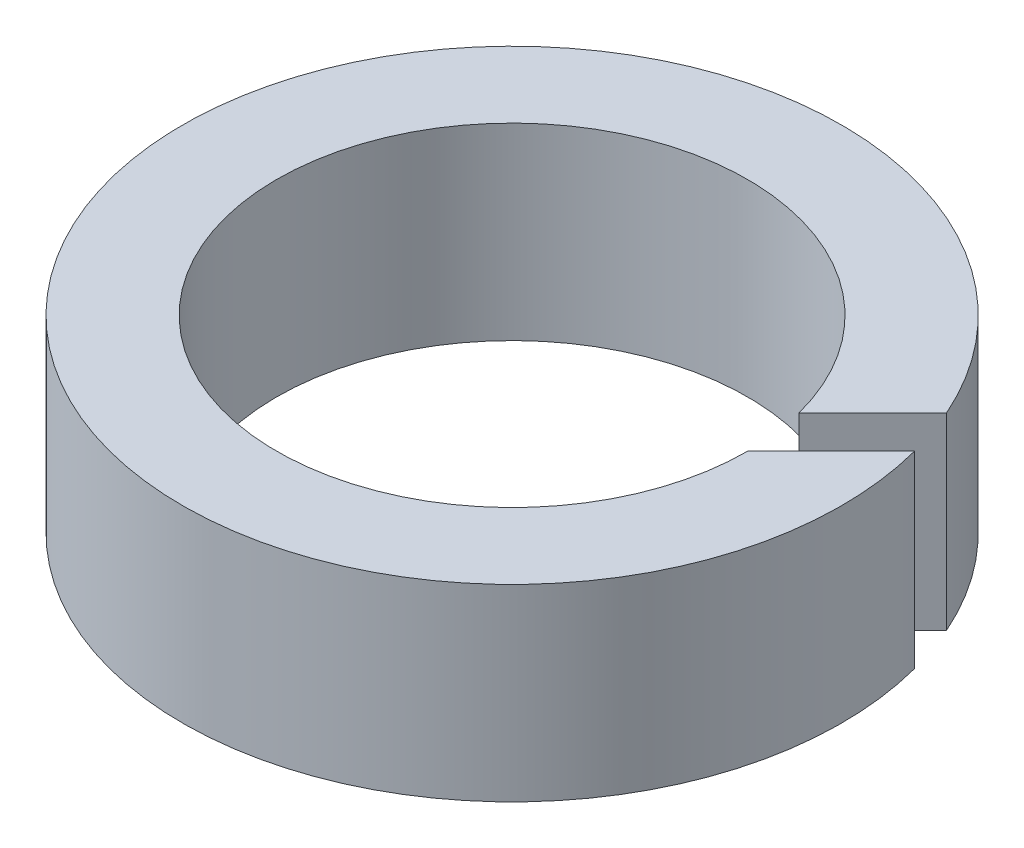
ISO-10303-21;
HEADER;
FILE_DESCRIPTION(('STEP AP214'),'2;1');
FILE_NAME('part.step','',(''),(''),'','','');
FILE_SCHEMA(('AUTOMOTIVE_DESIGN { 1 0 10303 214 1 1 1 1 }'));
ENDSEC;
DATA;
#1=APPLICATION_CONTEXT('core data for automotive mechanical design processes');
#2=APPLICATION_PROTOCOL_DEFINITION('international standard','automotive_design',2000,#1);
#3=PRODUCT_CONTEXT('',#1,'mechanical');
#4=PRODUCT('Part','Part','',(#3));
#5=PRODUCT_RELATED_PRODUCT_CATEGORY('part','',(#4));
#6=PRODUCT_DEFINITION_FORMATION('','',#4);
#7=PRODUCT_DEFINITION_CONTEXT('part definition',#1,'design');
#8=PRODUCT_DEFINITION('design','',#6,#7);
#9=PRODUCT_DEFINITION_SHAPE('','',#8);
#10=(LENGTH_UNIT() NAMED_UNIT(*) SI_UNIT(.MILLI.,.METRE.));
#11=(NAMED_UNIT(*) PLANE_ANGLE_UNIT() SI_UNIT($,.RADIAN.));
#12=(NAMED_UNIT(*) SI_UNIT($,.STERADIAN.) SOLID_ANGLE_UNIT());
#13=UNCERTAINTY_MEASURE_WITH_UNIT(LENGTH_MEASURE(1.E-05),#10,'distance_accuracy_value','');
#14=(GEOMETRIC_REPRESENTATION_CONTEXT(3) GLOBAL_UNCERTAINTY_ASSIGNED_CONTEXT((#13)) GLOBAL_UNIT_ASSIGNED_CONTEXT((#10,
#11,#12)) REPRESENTATION_CONTEXT('',''));
#15=CARTESIAN_POINT('',(0.,0.,0.));
#16=DIRECTION('',(0.,0.,1.));
#17=DIRECTION('',(1.,0.,0.));
#18=AXIS2_PLACEMENT_3D('',#15,#16,#17);
#19=CARTESIAN_POINT('',(0.,4.,0.));
#20=DIRECTION('',(0.,-1.,0.));
#21=DIRECTION('',(0.,0.,-1.));
#22=AXIS2_PLACEMENT_3D('',#19,#20,#21);
#23=CYLINDRICAL_SURFACE('',#22,5.);
#24=CARTESIAN_POINT('',(0.,0.,0.));
#25=DIRECTION('',(0.,-1.,0.));
#26=DIRECTION('',(0.,0.,1.));
#27=AXIS2_PLACEMENT_3D('',#24,#25,#26);
#28=CIRCLE('',#27,5.);
#29=CARTESIAN_POINT('',(5.,0.,0.));
#30=VERTEX_POINT('',#29);
#31=CARTESIAN_POINT('',(4.84011062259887,0.,-1.25432418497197));
#32=VERTEX_POINT('',#31);
#33=EDGE_CURVE('E96',#30,#32,#28,.T.);
#34=ORIENTED_EDGE('',*,*,#33,.T.);
#35=DIRECTION('',(0.,-1.,0.));
#36=VECTOR('',#35,1.);
#37=CARTESIAN_POINT('',(4.84011062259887,4.,-1.25432418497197));
#38=LINE('',#37,#36);
#39=CARTESIAN_POINT('',(4.84011062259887,4.,-1.25432418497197));
#40=VERTEX_POINT('',#39);
#41=EDGE_CURVE('E11',#40,#32,#38,.T.);
#42=ORIENTED_EDGE('',*,*,#41,.F.);
#43=CARTESIAN_POINT('',(0.,4.,0.));
#44=DIRECTION('',(0.,-1.,0.));
#45=DIRECTION('',(0.,0.,1.));
#46=AXIS2_PLACEMENT_3D('',#43,#44,#45);
#47=CIRCLE('',#46,5.);
#48=CARTESIAN_POINT('',(5.,4.,0.));
#49=VERTEX_POINT('',#48);
#50=EDGE_CURVE('E84',#49,#40,#47,.T.);
#51=ORIENTED_EDGE('',*,*,#50,.F.);
#52=DIRECTION('',(0.,-1.,0.));
#53=VECTOR('',#52,1.);
#54=CARTESIAN_POINT('',(5.,4.,0.));
#55=LINE('',#54,#53);
#56=EDGE_CURVE('E92',#49,#30,#55,.T.);
#57=ORIENTED_EDGE('',*,*,#56,.T.);
#58=EDGE_LOOP('',(#34,#42,#51,#57));
#59=FACE_BOUND('',#58,.T.);
#60=ADVANCED_FACE('F33',(#59),#23,.F.);
#61=CARTESIAN_POINT('',(4.84011062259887,4.,-1.25432418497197));
#62=DIRECTION('',(-0.707106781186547,0.,-0.707106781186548));
#63=DIRECTION('',(-0.707106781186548,0.,0.707106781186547));
#64=AXIS2_PLACEMENT_3D('',#61,#62,#63);
#65=PLANE('',#64);
#66=DIRECTION('',(0.707106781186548,0.,-0.707106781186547));
#67=VECTOR('',#66,1.);
#68=CARTESIAN_POINT('',(4.84011062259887,0.,-1.25432418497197));
#69=LINE('',#68,#67);
#70=CARTESIAN_POINT('',(6.40651803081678,0.,-2.82073159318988));
#71=VERTEX_POINT('',#70);
#72=EDGE_CURVE('E88',#32,#71,#69,.T.);
#73=ORIENTED_EDGE('',*,*,#72,.T.);
#74=DIRECTION('',(0.,-1.,0.));
#75=VECTOR('',#74,1.);
#76=CARTESIAN_POINT('',(6.40651803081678,4.,-2.82073159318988));
#77=LINE('',#76,#75);
#78=CARTESIAN_POINT('',(6.40651803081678,4.,-2.82073159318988));
#79=VERTEX_POINT('',#78);
#80=EDGE_CURVE('E41',#79,#71,#77,.T.);
#81=ORIENTED_EDGE('',*,*,#80,.F.);
#82=DIRECTION('',(0.707106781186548,0.,-0.707106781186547));
#83=VECTOR('',#82,1.);
#84=CARTESIAN_POINT('',(4.84011062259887,4.,-1.25432418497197));
#85=LINE('',#84,#83);
#86=EDGE_CURVE('E79',#40,#79,#85,.T.);
#87=ORIENTED_EDGE('',*,*,#86,.F.);
#88=ORIENTED_EDGE('',*,*,#41,.T.);
#89=EDGE_LOOP('',(#73,#81,#87,#88));
#90=FACE_BOUND('',#89,.T.);
#91=ADVANCED_FACE('F87',(#90),#65,.F.);
#92=CARTESIAN_POINT('',(0.,4.,0.));
#93=DIRECTION('',(0.,-1.,0.));
#94=DIRECTION('',(0.,0.,-1.));
#95=AXIS2_PLACEMENT_3D('',#92,#93,#94);
#96=CYLINDRICAL_SURFACE('',#95,7.);
#97=CARTESIAN_POINT('',(0.,0.,0.));
#98=DIRECTION('',(0.,1.,0.));
#99=DIRECTION('',(0.,0.,1.));
#100=AXIS2_PLACEMENT_3D('',#97,#98,#99);
#101=CIRCLE('',#100,7.);
#102=CARTESIAN_POINT('',(6.77200187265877,0.,-1.77200187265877));
#103=VERTEX_POINT('',#102);
#104=EDGE_CURVE('E66',#71,#103,#101,.T.);
#105=ORIENTED_EDGE('',*,*,#104,.T.);
#106=DIRECTION('',(0.,-1.,0.));
#107=VECTOR('',#106,1.);
#108=CARTESIAN_POINT('',(6.77200187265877,4.,-1.77200187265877));
#109=LINE('',#108,#107);
#110=CARTESIAN_POINT('',(6.77200187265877,4.,-1.77200187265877));
#111=VERTEX_POINT('',#110);
#112=EDGE_CURVE('E89',#111,#103,#109,.T.);
#113=ORIENTED_EDGE('',*,*,#112,.F.);
#114=CARTESIAN_POINT('',(0.,4.,0.));
#115=DIRECTION('',(0.,1.,0.));
#116=DIRECTION('',(0.,0.,1.));
#117=AXIS2_PLACEMENT_3D('',#114,#115,#116);
#118=CIRCLE('',#117,7.);
#119=EDGE_CURVE('E82',#79,#111,#118,.T.);
#120=ORIENTED_EDGE('',*,*,#119,.F.);
#121=ORIENTED_EDGE('',*,*,#80,.T.);
#122=EDGE_LOOP('',(#105,#113,#120,#121));
#123=FACE_BOUND('',#122,.T.);
#124=ADVANCED_FACE('F90',(#123),#96,.T.);
#125=CARTESIAN_POINT('',(5.,4.,0.));
#126=DIRECTION('',(0.707106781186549,0.,0.707106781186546));
#127=DIRECTION('',(0.707106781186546,0.,-0.707106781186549));
#128=AXIS2_PLACEMENT_3D('',#125,#126,#127);
#129=PLANE('',#128);
#130=DIRECTION('',(-0.707106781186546,0.,0.707106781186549));
#131=VECTOR('',#130,1.);
#132=CARTESIAN_POINT('',(5.,0.,0.));
#133=LINE('',#132,#131);
#134=EDGE_CURVE('E72',#103,#30,#133,.T.);
#135=ORIENTED_EDGE('',*,*,#134,.T.);
#136=ORIENTED_EDGE('',*,*,#56,.F.);
#137=DIRECTION('',(-0.707106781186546,0.,0.707106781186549));
#138=VECTOR('',#137,1.);
#139=CARTESIAN_POINT('',(5.,4.,0.));
#140=LINE('',#139,#138);
#141=EDGE_CURVE('E49',#111,#49,#140,.T.);
#142=ORIENTED_EDGE('',*,*,#141,.F.);
#143=ORIENTED_EDGE('',*,*,#112,.T.);
#144=EDGE_LOOP('',(#135,#136,#142,#143));
#145=FACE_BOUND('',#144,.T.);
#146=ADVANCED_FACE('F103',(#145),#129,.F.);
#147=CARTESIAN_POINT('',(0.,4.,0.));
#148=DIRECTION('',(0.,1.,0.));
#149=DIRECTION('',(0.,0.,1.));
#150=AXIS2_PLACEMENT_3D('',#147,#148,#149);
#151=PLANE('',#150);
#152=ORIENTED_EDGE('',*,*,#50,.T.);
#153=ORIENTED_EDGE('',*,*,#86,.T.);
#154=ORIENTED_EDGE('',*,*,#119,.T.);
#155=ORIENTED_EDGE('',*,*,#141,.T.);
#156=EDGE_LOOP('',(#152,#153,#154,#155));
#157=FACE_BOUND('',#156,.T.);
#158=ADVANCED_FACE('F80',(#157),#151,.T.);
#159=CARTESIAN_POINT('',(0.,0.,0.));
#160=DIRECTION('',(0.,1.,0.));
#161=DIRECTION('',(0.,0.,1.));
#162=AXIS2_PLACEMENT_3D('',#159,#160,#161);
#163=PLANE('',#162);
#164=ORIENTED_EDGE('',*,*,#33,.F.);
#165=ORIENTED_EDGE('',*,*,#134,.F.);
#166=ORIENTED_EDGE('',*,*,#104,.F.);
#167=ORIENTED_EDGE('',*,*,#72,.F.);
#168=EDGE_LOOP('',(#164,#165,#166,#167));
#169=FACE_BOUND('',#168,.T.);
#170=ADVANCED_FACE('F106',(#169),#163,.F.);
#171=CLOSED_SHELL('',(#60,#91,#124,#146,#158,#170));
#172=MANIFOLD_SOLID_BREP('B2',#171);
#173=ADVANCED_BREP_SHAPE_REPRESENTATION('',(#18,#172),#14);
#174=SHAPE_DEFINITION_REPRESENTATION(#9,#173);
ENDSEC;
END-ISO-10303-21;
